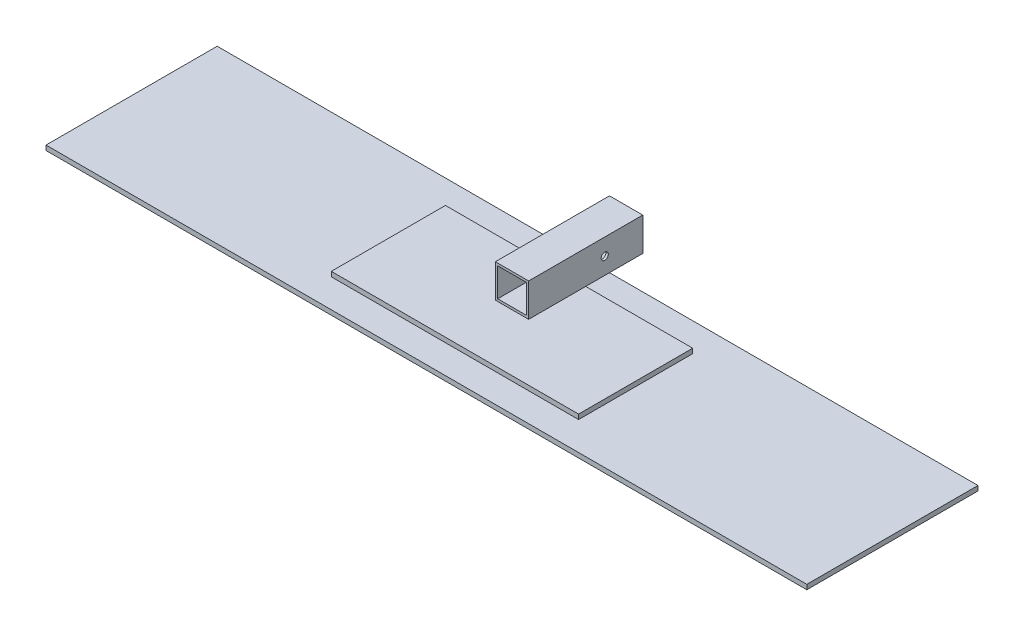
ISO-10303-21;
HEADER;
FILE_DESCRIPTION(('STEP AP214'),'2;1');
FILE_NAME('part.step','',(''),(''),'','','');
FILE_SCHEMA(('AUTOMOTIVE_DESIGN { 1 0 10303 214 1 1 1 1 }'));
ENDSEC;
DATA;
#1=APPLICATION_CONTEXT('core data for automotive mechanical design processes');
#2=APPLICATION_PROTOCOL_DEFINITION('international standard','automotive_design',2000,#1);
#3=PRODUCT_CONTEXT('',#1,'mechanical');
#4=PRODUCT('Part','Part','',(#3));
#5=PRODUCT_RELATED_PRODUCT_CATEGORY('part','',(#4));
#6=PRODUCT_DEFINITION_FORMATION('','',#4);
#7=PRODUCT_DEFINITION_CONTEXT('part definition',#1,'design');
#8=PRODUCT_DEFINITION('design','',#6,#7);
#9=PRODUCT_DEFINITION_SHAPE('','',#8);
#10=(LENGTH_UNIT() NAMED_UNIT(*) SI_UNIT(.MILLI.,.METRE.));
#11=(NAMED_UNIT(*) PLANE_ANGLE_UNIT() SI_UNIT($,.RADIAN.));
#12=(NAMED_UNIT(*) SI_UNIT($,.STERADIAN.) SOLID_ANGLE_UNIT());
#13=UNCERTAINTY_MEASURE_WITH_UNIT(LENGTH_MEASURE(1.E-05),#10,'distance_accuracy_value','');
#14=(GEOMETRIC_REPRESENTATION_CONTEXT(3) GLOBAL_UNCERTAINTY_ASSIGNED_CONTEXT((#13)) GLOBAL_UNIT_ASSIGNED_CONTEXT((#10,
#11,#12)) REPRESENTATION_CONTEXT('',''));
#15=CARTESIAN_POINT('',(0.,0.,0.));
#16=DIRECTION('',(0.,0.,1.));
#17=DIRECTION('',(1.,0.,0.));
#18=AXIS2_PLACEMENT_3D('',#15,#16,#17);
#19=CARTESIAN_POINT('',(0.,6.35,0.));
#20=DIRECTION('',(0.,-1.,0.));
#21=DIRECTION('',(0.,0.,-1.));
#22=AXIS2_PLACEMENT_3D('',#19,#20,#21);
#23=PLANE('',#22);
#24=DIRECTION('',(0.,0.,-1.));
#25=VECTOR('',#24,1.);
#26=CARTESIAN_POINT('',(508.,6.35,114.3));
#27=LINE('',#26,#25);
#28=CARTESIAN_POINT('',(508.,6.35,114.3));
#29=VERTEX_POINT('',#28);
#30=CARTESIAN_POINT('',(508.,6.35,-114.3));
#31=VERTEX_POINT('',#30);
#32=EDGE_CURVE('E264',#29,#31,#27,.T.);
#33=ORIENTED_EDGE('',*,*,#32,.T.);
#34=DIRECTION('',(-1.,0.,0.));
#35=VECTOR('',#34,1.);
#36=CARTESIAN_POINT('',(-508.,6.35,-114.3));
#37=LINE('',#36,#35);
#38=CARTESIAN_POINT('',(-508.,6.35,-114.3));
#39=VERTEX_POINT('',#38);
#40=EDGE_CURVE('E267',#31,#39,#37,.T.);
#41=ORIENTED_EDGE('',*,*,#40,.T.);
#42=DIRECTION('',(0.,0.,1.));
#43=VECTOR('',#42,1.);
#44=CARTESIAN_POINT('',(-508.,6.35,114.3));
#45=LINE('',#44,#43);
#46=CARTESIAN_POINT('',(-508.,6.35,114.3));
#47=VERTEX_POINT('',#46);
#48=EDGE_CURVE('E270',#39,#47,#45,.T.);
#49=ORIENTED_EDGE('',*,*,#48,.T.);
#50=DIRECTION('',(1.,0.,0.));
#51=VECTOR('',#50,1.);
#52=CARTESIAN_POINT('',(-508.,6.35,114.3));
#53=LINE('',#52,#51);
#54=EDGE_CURVE('E272',#47,#29,#53,.T.);
#55=ORIENTED_EDGE('',*,*,#54,.T.);
#56=EDGE_LOOP('',(#33,#41,#49,#55));
#57=FACE_BOUND('',#56,.T.);
#58=DIRECTION('',(0.,0.,1.));
#59=VECTOR('',#58,1.);
#60=CARTESIAN_POINT('',(-165.1,6.35,76.2));
#61=LINE('',#60,#59);
#62=CARTESIAN_POINT('',(-165.1,6.35,-76.2));
#63=VERTEX_POINT('',#62);
#64=CARTESIAN_POINT('',(-165.1,6.35,76.2));
#65=VERTEX_POINT('',#64);
#66=EDGE_CURVE('E225',#63,#65,#61,.T.);
#67=ORIENTED_EDGE('',*,*,#66,.F.);
#68=DIRECTION('',(-1.,0.,0.));
#69=VECTOR('',#68,1.);
#70=CARTESIAN_POINT('',(165.1,6.35,-76.2));
#71=LINE('',#70,#69);
#72=CARTESIAN_POINT('',(165.1,6.35,-76.2));
#73=VERTEX_POINT('',#72);
#74=EDGE_CURVE('E235',#73,#63,#71,.T.);
#75=ORIENTED_EDGE('',*,*,#74,.F.);
#76=DIRECTION('',(0.,0.,-1.));
#77=VECTOR('',#76,1.);
#78=CARTESIAN_POINT('',(165.1,6.35,76.2));
#79=LINE('',#78,#77);
#80=CARTESIAN_POINT('',(165.1,6.35,76.2));
#81=VERTEX_POINT('',#80);
#82=EDGE_CURVE('E248',#81,#73,#79,.T.);
#83=ORIENTED_EDGE('',*,*,#82,.F.);
#84=DIRECTION('',(1.,0.,0.));
#85=VECTOR('',#84,1.);
#86=CARTESIAN_POINT('',(165.1,6.35,76.2));
#87=LINE('',#86,#85);
#88=EDGE_CURVE('E59',#65,#81,#87,.T.);
#89=ORIENTED_EDGE('',*,*,#88,.F.);
#90=EDGE_LOOP('',(#67,#75,#83,#89));
#91=FACE_BOUND('',#90,.T.);
#92=ADVANCED_FACE('F33',(#57,#91),#23,.F.);
#93=CARTESIAN_POINT('',(508.,6.35,114.3));
#94=DIRECTION('',(-1.,0.,0.));
#95=DIRECTION('',(0.,0.,1.));
#96=AXIS2_PLACEMENT_3D('',#93,#94,#95);
#97=PLANE('',#96);
#98=DIRECTION('',(0.,0.,-1.));
#99=VECTOR('',#98,1.);
#100=CARTESIAN_POINT('',(508.,0.,114.3));
#101=LINE('',#100,#99);
#102=CARTESIAN_POINT('',(508.,0.,114.3));
#103=VERTEX_POINT('',#102);
#104=CARTESIAN_POINT('',(508.,0.,-114.3));
#105=VERTEX_POINT('',#104);
#106=EDGE_CURVE('E263',#103,#105,#101,.T.);
#107=ORIENTED_EDGE('',*,*,#106,.T.);
#108=DIRECTION('',(0.,-1.,0.));
#109=VECTOR('',#108,1.);
#110=CARTESIAN_POINT('',(508.,6.35,-114.3));
#111=LINE('',#110,#109);
#112=EDGE_CURVE('E289',#31,#105,#111,.T.);
#113=ORIENTED_EDGE('',*,*,#112,.F.);
#114=ORIENTED_EDGE('',*,*,#32,.F.);
#115=DIRECTION('',(0.,-1.,0.));
#116=VECTOR('',#115,1.);
#117=CARTESIAN_POINT('',(508.,6.35,114.3));
#118=LINE('',#117,#116);
#119=EDGE_CURVE('E274',#29,#103,#118,.T.);
#120=ORIENTED_EDGE('',*,*,#119,.T.);
#121=EDGE_LOOP('',(#107,#113,#114,#120));
#122=FACE_BOUND('',#121,.T.);
#123=ADVANCED_FACE('F35',(#122),#97,.F.);
#124=CARTESIAN_POINT('',(-508.,6.35,-114.3));
#125=DIRECTION('',(0.,0.,1.));
#126=DIRECTION('',(1.,0.,0.));
#127=AXIS2_PLACEMENT_3D('',#124,#125,#126);
#128=PLANE('',#127);
#129=DIRECTION('',(-1.,0.,0.));
#130=VECTOR('',#129,1.);
#131=CARTESIAN_POINT('',(-508.,0.,-114.3));
#132=LINE('',#131,#130);
#133=CARTESIAN_POINT('',(-508.,0.,-114.3));
#134=VERTEX_POINT('',#133);
#135=EDGE_CURVE('E277',#105,#134,#132,.T.);
#136=ORIENTED_EDGE('',*,*,#135,.T.);
#137=DIRECTION('',(0.,-1.,0.));
#138=VECTOR('',#137,1.);
#139=CARTESIAN_POINT('',(-508.,6.35,-114.3));
#140=LINE('',#139,#138);
#141=EDGE_CURVE('E287',#39,#134,#140,.T.);
#142=ORIENTED_EDGE('',*,*,#141,.F.);
#143=ORIENTED_EDGE('',*,*,#40,.F.);
#144=ORIENTED_EDGE('',*,*,#112,.T.);
#145=EDGE_LOOP('',(#136,#142,#143,#144));
#146=FACE_BOUND('',#145,.T.);
#147=ADVANCED_FACE('F328',(#146),#128,.F.);
#148=CARTESIAN_POINT('',(-508.,6.35,114.3));
#149=DIRECTION('',(1.,0.,0.));
#150=DIRECTION('',(0.,0.,-1.));
#151=AXIS2_PLACEMENT_3D('',#148,#149,#150);
#152=PLANE('',#151);
#153=DIRECTION('',(0.,0.,1.));
#154=VECTOR('',#153,1.);
#155=CARTESIAN_POINT('',(-508.,0.,114.3));
#156=LINE('',#155,#154);
#157=CARTESIAN_POINT('',(-508.,0.,114.3));
#158=VERTEX_POINT('',#157);
#159=EDGE_CURVE('E279',#134,#158,#156,.T.);
#160=ORIENTED_EDGE('',*,*,#159,.T.);
#161=DIRECTION('',(0.,-1.,0.));
#162=VECTOR('',#161,1.);
#163=CARTESIAN_POINT('',(-508.,6.35,114.3));
#164=LINE('',#163,#162);
#165=EDGE_CURVE('E284',#47,#158,#164,.T.);
#166=ORIENTED_EDGE('',*,*,#165,.F.);
#167=ORIENTED_EDGE('',*,*,#48,.F.);
#168=ORIENTED_EDGE('',*,*,#141,.T.);
#169=EDGE_LOOP('',(#160,#166,#167,#168));
#170=FACE_BOUND('',#169,.T.);
#171=ADVANCED_FACE('F340',(#170),#152,.F.);
#172=CARTESIAN_POINT('',(-508.,6.35,114.3));
#173=DIRECTION('',(0.,0.,-1.));
#174=DIRECTION('',(-1.,0.,0.));
#175=AXIS2_PLACEMENT_3D('',#172,#173,#174);
#176=PLANE('',#175);
#177=DIRECTION('',(1.,0.,0.));
#178=VECTOR('',#177,1.);
#179=CARTESIAN_POINT('',(-508.,0.,114.3));
#180=LINE('',#179,#178);
#181=EDGE_CURVE('E268',#158,#103,#180,.T.);
#182=ORIENTED_EDGE('',*,*,#181,.T.);
#183=ORIENTED_EDGE('',*,*,#119,.F.);
#184=ORIENTED_EDGE('',*,*,#54,.F.);
#185=ORIENTED_EDGE('',*,*,#165,.T.);
#186=EDGE_LOOP('',(#182,#183,#184,#185));
#187=FACE_BOUND('',#186,.T.);
#188=ADVANCED_FACE('F336',(#187),#176,.F.);
#189=CARTESIAN_POINT('',(0.,0.,0.));
#190=DIRECTION('',(0.,-1.,0.));
#191=DIRECTION('',(0.,0.,-1.));
#192=AXIS2_PLACEMENT_3D('',#189,#190,#191);
#193=PLANE('',#192);
#194=ORIENTED_EDGE('',*,*,#106,.F.);
#195=ORIENTED_EDGE('',*,*,#181,.F.);
#196=ORIENTED_EDGE('',*,*,#159,.F.);
#197=ORIENTED_EDGE('',*,*,#135,.F.);
#198=EDGE_LOOP('',(#194,#195,#196,#197));
#199=FACE_BOUND('',#198,.T.);
#200=ADVANCED_FACE('F333',(#199),#193,.T.);
#201=CARTESIAN_POINT('',(-165.1,12.7,76.2));
#202=DIRECTION('',(1.,0.,0.));
#203=DIRECTION('',(0.,0.,-1.));
#204=AXIS2_PLACEMENT_3D('',#201,#202,#203);
#205=PLANE('',#204);
#206=ORIENTED_EDGE('',*,*,#66,.T.);
#207=DIRECTION('',(0.,-1.,0.));
#208=VECTOR('',#207,1.);
#209=CARTESIAN_POINT('',(-165.1,12.7,76.2));
#210=LINE('',#209,#208);
#211=CARTESIAN_POINT('',(-165.1,12.7,76.2));
#212=VERTEX_POINT('',#211);
#213=EDGE_CURVE('E261',#212,#65,#210,.T.);
#214=ORIENTED_EDGE('',*,*,#213,.F.);
#215=DIRECTION('',(0.,0.,1.));
#216=VECTOR('',#215,1.);
#217=CARTESIAN_POINT('',(-165.1,12.7,76.2));
#218=LINE('',#217,#216);
#219=CARTESIAN_POINT('',(-165.1,12.7,-76.2));
#220=VERTEX_POINT('',#219);
#221=EDGE_CURVE('E231',#220,#212,#218,.T.);
#222=ORIENTED_EDGE('',*,*,#221,.F.);
#223=DIRECTION('',(0.,-1.,0.));
#224=VECTOR('',#223,1.);
#225=CARTESIAN_POINT('',(-165.1,12.7,-76.2));
#226=LINE('',#225,#224);
#227=EDGE_CURVE('E243',#220,#63,#226,.T.);
#228=ORIENTED_EDGE('',*,*,#227,.T.);
#229=EDGE_LOOP('',(#206,#214,#222,#228));
#230=FACE_BOUND('',#229,.T.);
#231=ADVANCED_FACE('F312',(#230),#205,.F.);
#232=CARTESIAN_POINT('',(165.1,12.7,76.2));
#233=DIRECTION('',(0.,0.,-1.));
#234=DIRECTION('',(-1.,0.,0.));
#235=AXIS2_PLACEMENT_3D('',#232,#233,#234);
#236=PLANE('',#235);
#237=ORIENTED_EDGE('',*,*,#88,.T.);
#238=DIRECTION('',(0.,-1.,0.));
#239=VECTOR('',#238,1.);
#240=CARTESIAN_POINT('',(165.1,12.7,76.2));
#241=LINE('',#240,#239);
#242=CARTESIAN_POINT('',(165.1,12.7,76.2));
#243=VERTEX_POINT('',#242);
#244=EDGE_CURVE('E258',#243,#81,#241,.T.);
#245=ORIENTED_EDGE('',*,*,#244,.F.);
#246=DIRECTION('',(1.,0.,0.));
#247=VECTOR('',#246,1.);
#248=CARTESIAN_POINT('',(165.1,12.7,76.2));
#249=LINE('',#248,#247);
#250=EDGE_CURVE('E234',#212,#243,#249,.T.);
#251=ORIENTED_EDGE('',*,*,#250,.F.);
#252=ORIENTED_EDGE('',*,*,#213,.T.);
#253=EDGE_LOOP('',(#237,#245,#251,#252));
#254=FACE_BOUND('',#253,.T.);
#255=ADVANCED_FACE('F314',(#254),#236,.F.);
#256=CARTESIAN_POINT('',(165.1,12.7,76.2));
#257=DIRECTION('',(-1.,0.,0.));
#258=DIRECTION('',(0.,0.,1.));
#259=AXIS2_PLACEMENT_3D('',#256,#257,#258);
#260=PLANE('',#259);
#261=ORIENTED_EDGE('',*,*,#82,.T.);
#262=DIRECTION('',(0.,-1.,0.));
#263=VECTOR('',#262,1.);
#264=CARTESIAN_POINT('',(165.1,12.7,-76.2));
#265=LINE('',#264,#263);
#266=CARTESIAN_POINT('',(165.1,12.7,-76.2));
#267=VERTEX_POINT('',#266);
#268=EDGE_CURVE('E255',#267,#73,#265,.T.);
#269=ORIENTED_EDGE('',*,*,#268,.F.);
#270=DIRECTION('',(0.,0.,-1.));
#271=VECTOR('',#270,1.);
#272=CARTESIAN_POINT('',(165.1,12.7,76.2));
#273=LINE('',#272,#271);
#274=EDGE_CURVE('E237',#243,#267,#273,.T.);
#275=ORIENTED_EDGE('',*,*,#274,.F.);
#276=ORIENTED_EDGE('',*,*,#244,.T.);
#277=EDGE_LOOP('',(#261,#269,#275,#276));
#278=FACE_BOUND('',#277,.T.);
#279=ADVANCED_FACE('F319',(#278),#260,.F.);
#280=CARTESIAN_POINT('',(165.1,12.7,-76.2));
#281=DIRECTION('',(0.,0.,1.));
#282=DIRECTION('',(1.,0.,0.));
#283=AXIS2_PLACEMENT_3D('',#280,#281,#282);
#284=PLANE('',#283);
#285=ORIENTED_EDGE('',*,*,#74,.T.);
#286=ORIENTED_EDGE('',*,*,#227,.F.);
#287=DIRECTION('',(-1.,0.,0.));
#288=VECTOR('',#287,1.);
#289=CARTESIAN_POINT('',(165.1,12.7,-76.2));
#290=LINE('',#289,#288);
#291=CARTESIAN_POINT('',(-22.225,12.7,-76.2000000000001));
#292=VERTEX_POINT('',#291);
#293=EDGE_CURVE('E239',#292,#220,#290,.T.);
#294=ORIENTED_EDGE('',*,*,#293,.F.);
#295=CARTESIAN_POINT('',(22.225,12.7,-76.2000000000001));
#296=VERTEX_POINT('',#295);
#297=EDGE_CURVE('E244',#296,#292,#290,.T.);
#298=ORIENTED_EDGE('',*,*,#297,.F.);
#299=EDGE_CURVE('E240',#267,#296,#290,.T.);
#300=ORIENTED_EDGE('',*,*,#299,.F.);
#301=ORIENTED_EDGE('',*,*,#268,.T.);
#302=EDGE_LOOP('',(#285,#286,#294,#298,#300,#301));
#303=FACE_BOUND('',#302,.T.);
#304=ADVANCED_FACE('F307',(#303),#284,.F.);
#305=CARTESIAN_POINT('',(0.,12.7,0.));
#306=DIRECTION('',(0.,1.,0.));
#307=DIRECTION('',(0.,0.,1.));
#308=AXIS2_PLACEMENT_3D('',#305,#306,#307);
#309=PLANE('',#308);
#310=DIRECTION('',(0.,0.,1.));
#311=VECTOR('',#310,1.);
#312=CARTESIAN_POINT('',(-22.225,12.7,-152.4));
#313=LINE('',#312,#311);
#314=CARTESIAN_POINT('',(-22.225,12.7,0.));
#315=VERTEX_POINT('',#314);
#316=EDGE_CURVE('E11',#292,#315,#313,.T.);
#317=ORIENTED_EDGE('',*,*,#316,.F.);
#318=ORIENTED_EDGE('',*,*,#293,.T.);
#319=ORIENTED_EDGE('',*,*,#221,.T.);
#320=ORIENTED_EDGE('',*,*,#250,.T.);
#321=ORIENTED_EDGE('',*,*,#274,.T.);
#322=ORIENTED_EDGE('',*,*,#299,.T.);
#323=DIRECTION('',(0.,0.,1.));
#324=VECTOR('',#323,1.);
#325=CARTESIAN_POINT('',(22.225,12.7,-152.4));
#326=LINE('',#325,#324);
#327=CARTESIAN_POINT('',(22.225,12.7,0.));
#328=VERTEX_POINT('',#327);
#329=EDGE_CURVE('E42',#296,#328,#326,.T.);
#330=ORIENTED_EDGE('',*,*,#329,.T.);
#331=DIRECTION('',(1.,0.,0.));
#332=VECTOR('',#331,1.);
#333=CARTESIAN_POINT('',(22.225,12.7,0.));
#334=LINE('',#333,#332);
#335=EDGE_CURVE('E51',#315,#328,#334,.T.);
#336=ORIENTED_EDGE('',*,*,#335,.F.);
#337=EDGE_LOOP('',(#317,#318,#319,#320,#321,#322,#330,#336));
#338=FACE_BOUND('',#337,.T.);
#339=ADVANCED_FACE('F296',(#338),#309,.T.);
#340=CARTESIAN_POINT('',(22.225,12.7,-152.4));
#341=DIRECTION('',(1.,0.,0.));
#342=DIRECTION('',(0.,1.,0.));
#343=AXIS2_PLACEMENT_3D('',#340,#341,#342);
#344=PLANE('',#343);
#345=CARTESIAN_POINT('',(22.225,34.925,-101.6));
#346=DIRECTION('',(1.,0.,0.));
#347=DIRECTION('',(0.,1.,0.));
#348=AXIS2_PLACEMENT_3D('',#345,#346,#347);
#349=CIRCLE('',#348,4.7625);
#350=CARTESIAN_POINT('',(22.2249999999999,30.1625,-101.6));
#351=VERTEX_POINT('',#350);
#352=EDGE_CURVE('E187',#351,#351,#349,.T.);
#353=ORIENTED_EDGE('',*,*,#352,.F.);
#354=EDGE_LOOP('',(#353));
#355=FACE_BOUND('',#354,.T.);
#356=DIRECTION('',(0.,1.,0.));
#357=VECTOR('',#356,1.);
#358=CARTESIAN_POINT('',(22.225,12.7,0.));
#359=LINE('',#358,#357);
#360=CARTESIAN_POINT('',(22.225,57.15,0.));
#361=VERTEX_POINT('',#360);
#362=EDGE_CURVE('E199',#328,#361,#359,.T.);
#363=ORIENTED_EDGE('',*,*,#362,.F.);
#364=ORIENTED_EDGE('',*,*,#329,.F.);
#365=CARTESIAN_POINT('',(22.225,12.7,-152.4));
#366=VERTEX_POINT('',#365);
#367=EDGE_CURVE('E223',#366,#296,#326,.T.);
#368=ORIENTED_EDGE('',*,*,#367,.F.);
#369=DIRECTION('',(0.,1.,0.));
#370=VECTOR('',#369,1.);
#371=CARTESIAN_POINT('',(22.225,12.7,-152.4));
#372=LINE('',#371,#370);
#373=CARTESIAN_POINT('',(22.225,57.15,-152.4));
#374=VERTEX_POINT('',#373);
#375=EDGE_CURVE('E203',#366,#374,#372,.T.);
#376=ORIENTED_EDGE('',*,*,#375,.T.);
#377=DIRECTION('',(0.,0.,1.));
#378=VECTOR('',#377,1.);
#379=CARTESIAN_POINT('',(22.225,57.15,-152.4));
#380=LINE('',#379,#378);
#381=EDGE_CURVE('E215',#374,#361,#380,.T.);
#382=ORIENTED_EDGE('',*,*,#381,.T.);
#383=EDGE_LOOP('',(#363,#364,#368,#376,#382));
#384=FACE_BOUND('',#383,.T.);
#385=ADVANCED_FACE('F299',(#355,#384),#344,.T.);
#386=CARTESIAN_POINT('',(22.225,12.7,-152.4));
#387=DIRECTION('',(0.,-1.,0.));
#388=DIRECTION('',(0.,0.,-1.));
#389=AXIS2_PLACEMENT_3D('',#386,#387,#388);
#390=PLANE('',#389);
#391=ORIENTED_EDGE('',*,*,#367,.T.);
#392=ORIENTED_EDGE('',*,*,#297,.T.);
#393=CARTESIAN_POINT('',(-22.225,12.7,-152.4));
#394=VERTEX_POINT('',#393);
#395=EDGE_CURVE('E44',#394,#292,#313,.T.);
#396=ORIENTED_EDGE('',*,*,#395,.F.);
#397=DIRECTION('',(1.,0.,0.));
#398=VECTOR('',#397,1.);
#399=CARTESIAN_POINT('',(22.225,12.7,-152.4));
#400=LINE('',#399,#398);
#401=EDGE_CURVE('E212',#394,#366,#400,.T.);
#402=ORIENTED_EDGE('',*,*,#401,.T.);
#403=EDGE_LOOP('',(#391,#392,#396,#402));
#404=FACE_BOUND('',#403,.T.);
#405=ADVANCED_FACE('F303',(#404),#390,.T.);
#406=CARTESIAN_POINT('',(-22.225,12.7,-152.4));
#407=DIRECTION('',(-1.,0.,0.));
#408=DIRECTION('',(0.,-1.,0.));
#409=AXIS2_PLACEMENT_3D('',#406,#407,#408);
#410=PLANE('',#409);
#411=CARTESIAN_POINT('',(-22.225,34.925,-101.6));
#412=DIRECTION('',(-1.,0.,0.));
#413=DIRECTION('',(0.,-1.,0.));
#414=AXIS2_PLACEMENT_3D('',#411,#412,#413);
#415=CIRCLE('',#414,4.7625);
#416=CARTESIAN_POINT('',(-22.225,30.1625,-101.6));
#417=VERTEX_POINT('',#416);
#418=EDGE_CURVE('E526',#417,#417,#415,.T.);
#419=ORIENTED_EDGE('',*,*,#418,.F.);
#420=EDGE_LOOP('',(#419));
#421=FACE_BOUND('',#420,.T.);
#422=DIRECTION('',(0.,-1.,0.));
#423=VECTOR('',#422,1.);
#424=CARTESIAN_POINT('',(-22.225,12.7,0.));
#425=LINE('',#424,#423);
#426=CARTESIAN_POINT('',(-22.225,57.15,0.));
#427=VERTEX_POINT('',#426);
#428=EDGE_CURVE('E220',#427,#315,#425,.T.);
#429=ORIENTED_EDGE('',*,*,#428,.F.);
#430=DIRECTION('',(0.,0.,1.));
#431=VECTOR('',#430,1.);
#432=CARTESIAN_POINT('',(-22.225,57.15,-152.4));
#433=LINE('',#432,#431);
#434=CARTESIAN_POINT('',(-22.225,57.15,-152.4));
#435=VERTEX_POINT('',#434);
#436=EDGE_CURVE('E228',#435,#427,#433,.T.);
#437=ORIENTED_EDGE('',*,*,#436,.F.);
#438=DIRECTION('',(0.,-1.,0.));
#439=VECTOR('',#438,1.);
#440=CARTESIAN_POINT('',(-22.225,12.7,-152.4));
#441=LINE('',#440,#439);
#442=EDGE_CURVE('E209',#435,#394,#441,.T.);
#443=ORIENTED_EDGE('',*,*,#442,.T.);
#444=ORIENTED_EDGE('',*,*,#395,.T.);
#445=ORIENTED_EDGE('',*,*,#316,.T.);
#446=EDGE_LOOP('',(#429,#437,#443,#444,#445));
#447=FACE_BOUND('',#446,.T.);
#448=ADVANCED_FACE('F415',(#421,#447),#410,.T.);
#449=CARTESIAN_POINT('',(22.225,57.15,-152.4));
#450=DIRECTION('',(0.,1.,0.));
#451=DIRECTION('',(-1.,0.,0.));
#452=AXIS2_PLACEMENT_3D('',#449,#450,#451);
#453=PLANE('',#452);
#454=DIRECTION('',(-1.,0.,0.));
#455=VECTOR('',#454,1.);
#456=CARTESIAN_POINT('',(22.225,57.15,0.));
#457=LINE('',#456,#455);
#458=EDGE_CURVE('E217',#361,#427,#457,.T.);
#459=ORIENTED_EDGE('',*,*,#458,.F.);
#460=ORIENTED_EDGE('',*,*,#381,.F.);
#461=DIRECTION('',(-1.,0.,0.));
#462=VECTOR('',#461,1.);
#463=CARTESIAN_POINT('',(22.225,57.15,-152.4));
#464=LINE('',#463,#462);
#465=EDGE_CURVE('E206',#374,#435,#464,.T.);
#466=ORIENTED_EDGE('',*,*,#465,.T.);
#467=ORIENTED_EDGE('',*,*,#436,.T.);
#468=EDGE_LOOP('',(#459,#460,#466,#467));
#469=FACE_BOUND('',#468,.T.);
#470=ADVANCED_FACE('F422',(#469),#453,.T.);
#471=CARTESIAN_POINT('',(0.,0.,-152.4));
#472=DIRECTION('',(0.,0.,1.));
#473=DIRECTION('',(1.,0.,0.));
#474=AXIS2_PLACEMENT_3D('',#471,#472,#473);
#475=PLANE('',#474);
#476=DIRECTION('',(-1.,0.,0.));
#477=VECTOR('',#476,1.);
#478=CARTESIAN_POINT('',(-19.05,53.975,-152.4));
#479=LINE('',#478,#477);
#480=CARTESIAN_POINT('',(19.05,53.975,-152.4));
#481=VERTEX_POINT('',#480);
#482=CARTESIAN_POINT('',(-19.05,53.975,-152.4));
#483=VERTEX_POINT('',#482);
#484=EDGE_CURVE('E168',#481,#483,#479,.T.);
#485=ORIENTED_EDGE('',*,*,#484,.T.);
#486=DIRECTION('',(0.,-1.,0.));
#487=VECTOR('',#486,1.);
#488=CARTESIAN_POINT('',(-19.05,15.875,-152.4));
#489=LINE('',#488,#487);
#490=CARTESIAN_POINT('',(-19.05,15.875,-152.4));
#491=VERTEX_POINT('',#490);
#492=EDGE_CURVE('E160',#483,#491,#489,.T.);
#493=ORIENTED_EDGE('',*,*,#492,.T.);
#494=DIRECTION('',(1.,0.,0.));
#495=VECTOR('',#494,1.);
#496=CARTESIAN_POINT('',(-19.05,15.875,-152.4));
#497=LINE('',#496,#495);
#498=CARTESIAN_POINT('',(19.05,15.875,-152.4));
#499=VERTEX_POINT('',#498);
#500=EDGE_CURVE('E172',#491,#499,#497,.T.);
#501=ORIENTED_EDGE('',*,*,#500,.T.);
#502=DIRECTION('',(0.,1.,0.));
#503=VECTOR('',#502,1.);
#504=CARTESIAN_POINT('',(19.05,15.875,-152.4));
#505=LINE('',#504,#503);
#506=EDGE_CURVE('E176',#499,#481,#505,.T.);
#507=ORIENTED_EDGE('',*,*,#506,.T.);
#508=EDGE_LOOP('',(#485,#493,#501,#507));
#509=FACE_BOUND('',#508,.T.);
#510=ORIENTED_EDGE('',*,*,#375,.F.);
#511=ORIENTED_EDGE('',*,*,#401,.F.);
#512=ORIENTED_EDGE('',*,*,#442,.F.);
#513=ORIENTED_EDGE('',*,*,#465,.F.);
#514=EDGE_LOOP('',(#510,#511,#512,#513));
#515=FACE_BOUND('',#514,.T.);
#516=ADVANCED_FACE('F178',(#509,#515),#475,.F.);
#517=CARTESIAN_POINT('',(0.,0.,0.));
#518=DIRECTION('',(0.,0.,1.));
#519=DIRECTION('',(1.,0.,0.));
#520=AXIS2_PLACEMENT_3D('',#517,#518,#519);
#521=PLANE('',#520);
#522=DIRECTION('',(0.,-1.,0.));
#523=VECTOR('',#522,1.);
#524=CARTESIAN_POINT('',(-19.05,15.875,0.));
#525=LINE('',#524,#523);
#526=CARTESIAN_POINT('',(-19.05,53.975,0.));
#527=VERTEX_POINT('',#526);
#528=CARTESIAN_POINT('',(-19.05,15.875,0.));
#529=VERTEX_POINT('',#528);
#530=EDGE_CURVE('E163',#527,#529,#525,.T.);
#531=ORIENTED_EDGE('',*,*,#530,.F.);
#532=DIRECTION('',(-1.,0.,0.));
#533=VECTOR('',#532,1.);
#534=CARTESIAN_POINT('',(-19.05,53.975,0.));
#535=LINE('',#534,#533);
#536=CARTESIAN_POINT('',(19.05,53.975,0.));
#537=VERTEX_POINT('',#536);
#538=EDGE_CURVE('E181',#537,#527,#535,.T.);
#539=ORIENTED_EDGE('',*,*,#538,.F.);
#540=DIRECTION('',(0.,1.,0.));
#541=VECTOR('',#540,1.);
#542=CARTESIAN_POINT('',(19.05,15.875,0.));
#543=LINE('',#542,#541);
#544=CARTESIAN_POINT('',(19.05,15.875,0.));
#545=VERTEX_POINT('',#544);
#546=EDGE_CURVE('E184',#545,#537,#543,.T.);
#547=ORIENTED_EDGE('',*,*,#546,.F.);
#548=DIRECTION('',(1.,0.,0.));
#549=VECTOR('',#548,1.);
#550=CARTESIAN_POINT('',(-19.05,15.875,0.));
#551=LINE('',#550,#549);
#552=EDGE_CURVE('E193',#529,#545,#551,.T.);
#553=ORIENTED_EDGE('',*,*,#552,.F.);
#554=EDGE_LOOP('',(#531,#539,#547,#553));
#555=FACE_BOUND('',#554,.T.);
#556=ORIENTED_EDGE('',*,*,#362,.T.);
#557=ORIENTED_EDGE('',*,*,#458,.T.);
#558=ORIENTED_EDGE('',*,*,#428,.T.);
#559=ORIENTED_EDGE('',*,*,#335,.T.);
#560=EDGE_LOOP('',(#556,#557,#558,#559));
#561=FACE_BOUND('',#560,.T.);
#562=ADVANCED_FACE('F437',(#555,#561),#521,.T.);
#563=CARTESIAN_POINT('',(-19.05,15.875,-152.4));
#564=DIRECTION('',(-1.,0.,0.));
#565=DIRECTION('',(0.,0.,1.));
#566=AXIS2_PLACEMENT_3D('',#563,#564,#565);
#567=PLANE('',#566);
#568=CARTESIAN_POINT('',(-19.05,34.925,-101.6));
#569=DIRECTION('',(-1.,0.,0.));
#570=DIRECTION('',(0.,0.,1.));
#571=AXIS2_PLACEMENT_3D('',#568,#569,#570);
#572=CIRCLE('',#571,4.7625);
#573=CARTESIAN_POINT('',(-19.05,34.925,-96.8375));
#574=VERTEX_POINT('',#573);
#575=EDGE_CURVE('E529',#574,#574,#572,.T.);
#576=ORIENTED_EDGE('',*,*,#575,.T.);
#577=EDGE_LOOP('',(#576));
#578=FACE_BOUND('',#577,.T.);
#579=ORIENTED_EDGE('',*,*,#530,.T.);
#580=DIRECTION('',(0.,0.,1.));
#581=VECTOR('',#580,1.);
#582=CARTESIAN_POINT('',(-19.05,15.875,-152.4));
#583=LINE('',#582,#581);
#584=EDGE_CURVE('E156',#491,#529,#583,.T.);
#585=ORIENTED_EDGE('',*,*,#584,.F.);
#586=ORIENTED_EDGE('',*,*,#492,.F.);
#587=DIRECTION('',(0.,0.,1.));
#588=VECTOR('',#587,1.);
#589=CARTESIAN_POINT('',(-19.05,53.975,-152.4));
#590=LINE('',#589,#588);
#591=EDGE_CURVE('E197',#483,#527,#590,.T.);
#592=ORIENTED_EDGE('',*,*,#591,.T.);
#593=EDGE_LOOP('',(#579,#585,#586,#592));
#594=FACE_BOUND('',#593,.T.);
#595=ADVANCED_FACE('F158',(#578,#594),#567,.F.);
#596=CARTESIAN_POINT('',(-19.05,53.975,-152.4));
#597=DIRECTION('',(0.,1.,0.));
#598=DIRECTION('',(0.,0.,1.));
#599=AXIS2_PLACEMENT_3D('',#596,#597,#598);
#600=PLANE('',#599);
#601=ORIENTED_EDGE('',*,*,#538,.T.);
#602=ORIENTED_EDGE('',*,*,#591,.F.);
#603=ORIENTED_EDGE('',*,*,#484,.F.);
#604=DIRECTION('',(0.,0.,1.));
#605=VECTOR('',#604,1.);
#606=CARTESIAN_POINT('',(19.05,53.975,-152.4));
#607=LINE('',#606,#605);
#608=EDGE_CURVE('E200',#481,#537,#607,.T.);
#609=ORIENTED_EDGE('',*,*,#608,.T.);
#610=EDGE_LOOP('',(#601,#602,#603,#609));
#611=FACE_BOUND('',#610,.T.);
#612=ADVANCED_FACE('F451',(#611),#600,.F.);
#613=CARTESIAN_POINT('',(19.05,15.875,-152.4));
#614=DIRECTION('',(1.,0.,0.));
#615=DIRECTION('',(0.,1.,0.));
#616=AXIS2_PLACEMENT_3D('',#613,#614,#615);
#617=PLANE('',#616);
#618=CARTESIAN_POINT('',(19.05,34.925,-101.6));
#619=DIRECTION('',(1.,0.,0.));
#620=DIRECTION('',(0.,1.,0.));
#621=AXIS2_PLACEMENT_3D('',#618,#619,#620);
#622=CIRCLE('',#621,4.7625);
#623=CARTESIAN_POINT('',(19.05,30.1625,-101.6));
#624=VERTEX_POINT('',#623);
#625=EDGE_CURVE('E37',#624,#624,#622,.T.);
#626=ORIENTED_EDGE('',*,*,#625,.T.);
#627=EDGE_LOOP('',(#626));
#628=FACE_BOUND('',#627,.T.);
#629=ORIENTED_EDGE('',*,*,#546,.T.);
#630=ORIENTED_EDGE('',*,*,#608,.F.);
#631=ORIENTED_EDGE('',*,*,#506,.F.);
#632=DIRECTION('',(0.,0.,1.));
#633=VECTOR('',#632,1.);
#634=CARTESIAN_POINT('',(19.05,15.875,-152.4));
#635=LINE('',#634,#633);
#636=EDGE_CURVE('E167',#499,#545,#635,.T.);
#637=ORIENTED_EDGE('',*,*,#636,.T.);
#638=EDGE_LOOP('',(#629,#630,#631,#637));
#639=FACE_BOUND('',#638,.T.);
#640=ADVANCED_FACE('F459',(#628,#639),#617,.F.);
#641=CARTESIAN_POINT('',(-19.05,15.875,-152.4));
#642=DIRECTION('',(0.,-1.,0.));
#643=DIRECTION('',(1.,0.,0.));
#644=AXIS2_PLACEMENT_3D('',#641,#642,#643);
#645=PLANE('',#644);
#646=ORIENTED_EDGE('',*,*,#552,.T.);
#647=ORIENTED_EDGE('',*,*,#636,.F.);
#648=ORIENTED_EDGE('',*,*,#500,.F.);
#649=ORIENTED_EDGE('',*,*,#584,.T.);
#650=EDGE_LOOP('',(#646,#647,#648,#649));
#651=FACE_BOUND('',#650,.T.);
#652=ADVANCED_FACE('F173',(#651),#645,.F.);
#653=CARTESIAN_POINT('',(508.,34.9250000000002,-101.6));
#654=DIRECTION('',(-1.,0.,0.));
#655=DIRECTION('',(0.,-1.,0.));
#656=AXIS2_PLACEMENT_3D('',#653,#654,#655);
#657=CYLINDRICAL_SURFACE('',#656,4.7625);
#658=CARTESIAN_POINT('',(22.2249999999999,30.1625,-101.6));
#659=CARTESIAN_POINT('',(22.1919270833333,30.1625,-101.6));
#660=CARTESIAN_POINT('',(22.1588541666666,30.1625,-101.6));
#661=CARTESIAN_POINT('',(22.0927083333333,30.1625,-101.6));
#662=CARTESIAN_POINT('',(22.0596354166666,30.1625,-101.6));
#663=CARTESIAN_POINT('',(21.9934895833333,30.1625,-101.6));
#664=CARTESIAN_POINT('',(21.9604166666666,30.1625,-101.6));
#665=CARTESIAN_POINT('',(21.8942708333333,30.1625,-101.6));
#666=CARTESIAN_POINT('',(21.8611979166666,30.1625,-101.6));
#667=CARTESIAN_POINT('',(21.7950520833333,30.1625,-101.6));
#668=CARTESIAN_POINT('',(21.7619791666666,30.1625,-101.6));
#669=CARTESIAN_POINT('',(21.6958333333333,30.1625,-101.6));
#670=CARTESIAN_POINT('',(21.6627604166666,30.1625,-101.6));
#671=CARTESIAN_POINT('',(21.5966145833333,30.1625,-101.6));
#672=CARTESIAN_POINT('',(21.5635416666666,30.1625,-101.6));
#673=CARTESIAN_POINT('',(21.4973958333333,30.1625,-101.6));
#674=CARTESIAN_POINT('',(21.4643229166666,30.1625,-101.6));
#675=CARTESIAN_POINT('',(21.3981770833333,30.1625,-101.6));
#676=CARTESIAN_POINT('',(21.3651041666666,30.1625,-101.6));
#677=CARTESIAN_POINT('',(21.2989583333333,30.1625,-101.6));
#678=CARTESIAN_POINT('',(21.2658854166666,30.1625,-101.6));
#679=CARTESIAN_POINT('',(21.1997395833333,30.1625,-101.6));
#680=CARTESIAN_POINT('',(21.1666666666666,30.1625,-101.6));
#681=CARTESIAN_POINT('',(21.1005208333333,30.1625,-101.6));
#682=CARTESIAN_POINT('',(21.0674479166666,30.1625,-101.6));
#683=CARTESIAN_POINT('',(21.0013020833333,30.1625,-101.6));
#684=CARTESIAN_POINT('',(20.9682291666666,30.1625,-101.6));
#685=CARTESIAN_POINT('',(20.9020833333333,30.1625,-101.6));
#686=CARTESIAN_POINT('',(20.8690104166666,30.1625,-101.6));
#687=CARTESIAN_POINT('',(20.8028645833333,30.1625,-101.6));
#688=CARTESIAN_POINT('',(20.7697916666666,30.1625,-101.6));
#689=CARTESIAN_POINT('',(20.7036458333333,30.1625,-101.6));
#690=CARTESIAN_POINT('',(20.6705729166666,30.1625,-101.6));
#691=CARTESIAN_POINT('',(20.6044270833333,30.1625,-101.6));
#692=CARTESIAN_POINT('',(20.5713541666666,30.1625,-101.6));
#693=CARTESIAN_POINT('',(20.5052083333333,30.1625,-101.6));
#694=CARTESIAN_POINT('',(20.4721354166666,30.1625,-101.6));
#695=CARTESIAN_POINT('',(20.4059895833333,30.1625,-101.6));
#696=CARTESIAN_POINT('',(20.3729166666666,30.1625,-101.6));
#697=CARTESIAN_POINT('',(20.3067708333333,30.1625,-101.6));
#698=CARTESIAN_POINT('',(20.2736979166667,30.1625,-101.6));
#699=CARTESIAN_POINT('',(20.2075520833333,30.1625,-101.6));
#700=CARTESIAN_POINT('',(20.1744791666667,30.1625,-101.6));
#701=CARTESIAN_POINT('',(20.1083333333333,30.1625,-101.6));
#702=CARTESIAN_POINT('',(20.0752604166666,30.1625,-101.6));
#703=CARTESIAN_POINT('',(20.0091145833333,30.1625,-101.6));
#704=CARTESIAN_POINT('',(19.9760416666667,30.1625,-101.6));
#705=CARTESIAN_POINT('',(19.9098958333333,30.1625,-101.6));
#706=CARTESIAN_POINT('',(19.8768229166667,30.1625,-101.6));
#707=CARTESIAN_POINT('',(19.8106770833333,30.1625,-101.6));
#708=CARTESIAN_POINT('',(19.7776041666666,30.1625,-101.6));
#709=CARTESIAN_POINT('',(19.7114583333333,30.1625,-101.6));
#710=CARTESIAN_POINT('',(19.6783854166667,30.1625,-101.6));
#711=CARTESIAN_POINT('',(19.6122395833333,30.1625,-101.6));
#712=CARTESIAN_POINT('',(19.5791666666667,30.1625,-101.6));
#713=CARTESIAN_POINT('',(19.5130208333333,30.1625,-101.6));
#714=CARTESIAN_POINT('',(19.4799479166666,30.1625,-101.6));
#715=CARTESIAN_POINT('',(19.4138020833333,30.1625,-101.6));
#716=CARTESIAN_POINT('',(19.3807291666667,30.1625,-101.6));
#717=CARTESIAN_POINT('',(19.3145833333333,30.1625,-101.6));
#718=CARTESIAN_POINT('',(19.2815104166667,30.1625,-101.6));
#719=CARTESIAN_POINT('',(19.2153645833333,30.1625,-101.6));
#720=CARTESIAN_POINT('',(19.1822916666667,30.1625,-101.6));
#721=CARTESIAN_POINT('',(19.1161458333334,30.1625,-101.6));
#722=CARTESIAN_POINT('',(19.0830729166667,30.1625,-101.6));
#723=CARTESIAN_POINT('',(19.05,30.1625,-101.6));
#724=B_SPLINE_CURVE_WITH_KNOTS('',3,(#658,#659,#660,#661,#662,#663,#664,#665,#666,#667,#668,
#669,#670,#671,#672,#673,#674,#675,#676,#677,#678,#679,#680,#681,#682,#683,#684,#685,#686,#687,
#688,#689,#690,#691,#692,#693,#694,#695,#696,#697,#698,#699,#700,#701,#702,#703,#704,#705,#706,
#707,#708,#709,#710,#711,#712,#713,#714,#715,#716,#717,#718,#719,#720,#721,#722,#723),
.UNSPECIFIED.,.F.,.F.,(4,2,2,2,2,2,2,2,2,2,2,2,2,2,2,2,2,2,2,2,2,2,2,2,2,2,2,2,2,2,2,2,4),(0.,
0.0992187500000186,0.198437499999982,0.29765625,0.396874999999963,0.496093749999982,0.5953125,
0.694531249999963,0.793749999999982,0.892968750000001,0.992187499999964,1.09140624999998,
1.190625,1.28984374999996,1.38906249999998,1.48828124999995,1.58749999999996,1.68671874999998,
1.78593749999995,1.88515624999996,1.98437499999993,2.08359374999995,2.18281249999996,
2.28203124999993,2.38124999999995,2.48046874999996,2.57968749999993,2.67890624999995,
2.77812499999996,2.87734374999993,2.97656249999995,3.07578124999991,3.17499999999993),.UNSPECIFIED.);
#725=EDGE_CURVE('BSEAM473',#351,#624,#724,.T.);
#726=ORIENTED_EDGE('',*,*,#352,.T.);
#727=ORIENTED_EDGE('',*,*,#625,.F.);
#728=ORIENTED_EDGE('',*,*,#725,.T.);
#729=ORIENTED_EDGE('',*,*,#725,.F.);
#730=EDGE_LOOP('',(#726,#728,#727,#729));
#731=FACE_BOUND('',#730,.T.);
#732=ADVANCED_FACE('F473',(#731),#657,.F.);
#733=ORIENTED_EDGE('',*,*,#418,.T.);
#734=EDGE_LOOP('',(#733));
#735=FACE_BOUND('',#734,.T.);
#736=ORIENTED_EDGE('',*,*,#575,.F.);
#737=EDGE_LOOP('',(#736));
#738=FACE_BOUND('',#737,.T.);
#739=ADVANCED_FACE('F479',(#735,#738),#657,.F.);
#740=CLOSED_SHELL('',(#92,#123,#147,#171,#188,#200,#231,#255,#279,#304,#339,#385,#405,#448,#470,
#516,#562,#595,#612,#640,#652,#732,#739));
#741=MANIFOLD_SOLID_BREP('B2',#740);
#742=ADVANCED_BREP_SHAPE_REPRESENTATION('',(#18,#741),#14);
#743=SHAPE_DEFINITION_REPRESENTATION(#9,#742);
ENDSEC;
END-ISO-10303-21;
